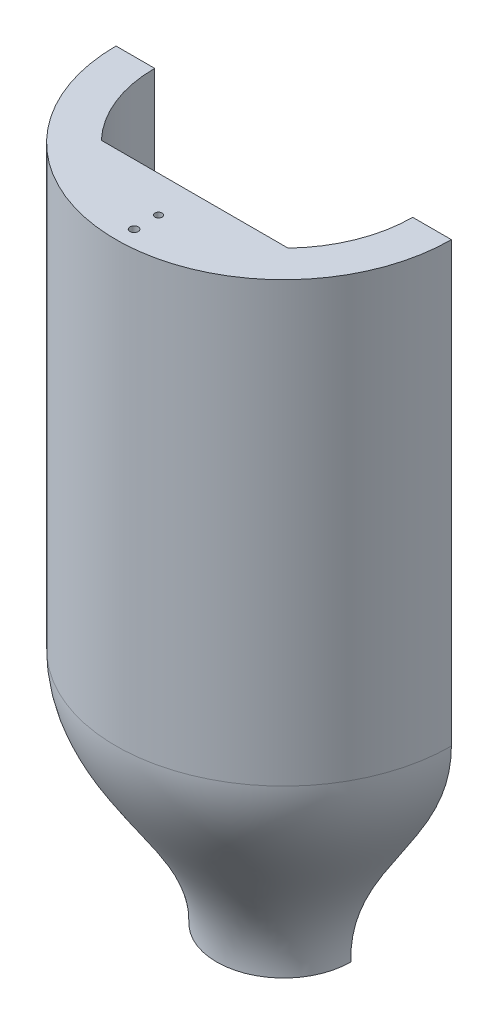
ISO-10303-21;
HEADER;
FILE_DESCRIPTION(('STEP AP214'),'2;1');
FILE_NAME('part.step','',(''),(''),'','','');
FILE_SCHEMA(('AUTOMOTIVE_DESIGN { 1 0 10303 214 1 1 1 1 }'));
ENDSEC;
DATA;
#1=APPLICATION_CONTEXT('core data for automotive mechanical design processes');
#2=APPLICATION_PROTOCOL_DEFINITION('international standard','automotive_design',2000,#1);
#3=PRODUCT_CONTEXT('',#1,'mechanical');
#4=PRODUCT('Part','Part','',(#3));
#5=PRODUCT_RELATED_PRODUCT_CATEGORY('part','',(#4));
#6=PRODUCT_DEFINITION_FORMATION('','',#4);
#7=PRODUCT_DEFINITION_CONTEXT('part definition',#1,'design');
#8=PRODUCT_DEFINITION('design','',#6,#7);
#9=PRODUCT_DEFINITION_SHAPE('','',#8);
#10=(LENGTH_UNIT() NAMED_UNIT(*) SI_UNIT(.MILLI.,.METRE.));
#11=(NAMED_UNIT(*) PLANE_ANGLE_UNIT() SI_UNIT($,.RADIAN.));
#12=(NAMED_UNIT(*) SI_UNIT($,.STERADIAN.) SOLID_ANGLE_UNIT());
#13=UNCERTAINTY_MEASURE_WITH_UNIT(LENGTH_MEASURE(1.E-05),#10,'distance_accuracy_value','');
#14=(GEOMETRIC_REPRESENTATION_CONTEXT(3) GLOBAL_UNCERTAINTY_ASSIGNED_CONTEXT((#13)) GLOBAL_UNIT_ASSIGNED_CONTEXT((#10,
#11,#12)) REPRESENTATION_CONTEXT('',''));
#15=CARTESIAN_POINT('',(0.,0.,0.));
#16=DIRECTION('',(0.,0.,1.));
#17=DIRECTION('',(1.,0.,0.));
#18=AXIS2_PLACEMENT_3D('',#15,#16,#17);
#19=CARTESIAN_POINT('',(-32.5,85.,0.));
#20=DIRECTION('',(0.,0.,1.));
#21=DIRECTION('',(1.,0.,0.));
#22=AXIS2_PLACEMENT_3D('',#19,#20,#21);
#23=PLANE('',#22);
#24=CARTESIAN_POINT('',(23.8066094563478,-16.,0.));
#25=DIRECTION('',(0.,0.,-1.));
#26=DIRECTION('',(-1.,0.,0.));
#27=AXIS2_PLACEMENT_3D('',#24,#25,#26);
#28=CIRCLE('',#27,0.799999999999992);
#29=CARTESIAN_POINT('',(23.0066094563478,-16.,0.));
#30=VERTEX_POINT('',#29);
#31=EDGE_CURVE('E149',#30,#30,#28,.T.);
#32=ORIENTED_EDGE('',*,*,#31,.F.);
#33=EDGE_LOOP('',(#32));
#34=FACE_BOUND('',#33,.T.);
#35=CARTESIAN_POINT('',(28.8066094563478,19.,0.));
#36=DIRECTION('',(0.,0.,-1.));
#37=DIRECTION('',(-1.,0.,0.));
#38=AXIS2_PLACEMENT_3D('',#35,#36,#37);
#39=CIRCLE('',#38,0.799999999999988);
#40=CARTESIAN_POINT('',(28.0066094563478,19.,0.));
#41=VERTEX_POINT('',#40);
#42=EDGE_CURVE('E166',#41,#41,#39,.T.);
#43=ORIENTED_EDGE('',*,*,#42,.F.);
#44=EDGE_LOOP('',(#43));
#45=FACE_BOUND('',#44,.T.);
#46=CARTESIAN_POINT('',(28.8,67.,0.));
#47=DIRECTION('',(0.,0.,-1.));
#48=DIRECTION('',(-1.,0.,0.));
#49=AXIS2_PLACEMENT_3D('',#46,#47,#48);
#50=CIRCLE('',#49,0.799999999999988);
#51=CARTESIAN_POINT('',(28.,67.,0.));
#52=VERTEX_POINT('',#51);
#53=EDGE_CURVE('E184',#52,#52,#50,.T.);
#54=ORIENTED_EDGE('',*,*,#53,.F.);
#55=EDGE_LOOP('',(#54));
#56=FACE_BOUND('',#55,.T.);
#57=DIRECTION('',(1.,0.,0.));
#58=VECTOR('',#57,1.);
#59=CARTESIAN_POINT('',(0.00476582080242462,-46.,0.));
#60=LINE('',#59,#58);
#61=CARTESIAN_POINT('',(8.30660945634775,-46.,0.));
#62=VERTEX_POINT('',#61);
#63=CARTESIAN_POINT('',(13.0047658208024,-46.,0.));
#64=VERTEX_POINT('',#63);
#65=EDGE_CURVE('E357',#62,#64,#60,.T.);
#66=ORIENTED_EDGE('',*,*,#65,.F.);
#67=CARTESIAN_POINT('',(25.,0.,0.));
#68=CARTESIAN_POINT('',(25.2586533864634,-16.633418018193,0.));
#69=CARTESIAN_POINT('',(9.46106074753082,-29.3804159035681,0.));
#70=CARTESIAN_POINT('',(8.30660945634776,-46.,0.));
#71=B_SPLINE_CURVE_WITH_KNOTS('',3,(#67,#68,#69,#70),.UNSPECIFIED.,.F.,.F.,(4,4),(0.,1.),.UNSPECIFIED.);
#72=CARTESIAN_POINT('',(25.,0.,0.));
#73=VERTEX_POINT('',#72);
#74=EDGE_CURVE('E61',#73,#62,#71,.T.);
#75=ORIENTED_EDGE('',*,*,#74,.F.);
#76=DIRECTION('',(0.,-1.,0.));
#77=VECTOR('',#76,1.);
#78=CARTESIAN_POINT('',(25.,160.,0.));
#79=LINE('',#78,#77);
#80=CARTESIAN_POINT('',(25.,85.,0.));
#81=VERTEX_POINT('',#80);
#82=EDGE_CURVE('E395',#81,#73,#79,.T.);
#83=ORIENTED_EDGE('',*,*,#82,.F.);
#84=DIRECTION('',(-1.,0.,0.));
#85=VECTOR('',#84,1.);
#86=CARTESIAN_POINT('',(-32.5,85.,0.));
#87=LINE('',#86,#85);
#88=CARTESIAN_POINT('',(32.5,85.,0.));
#89=VERTEX_POINT('',#88);
#90=EDGE_CURVE('E411',#89,#81,#87,.T.);
#91=ORIENTED_EDGE('',*,*,#90,.F.);
#92=DIRECTION('',(0.,-1.,0.));
#93=VECTOR('',#92,1.);
#94=CARTESIAN_POINT('',(32.5,85.,0.));
#95=LINE('',#94,#93);
#96=CARTESIAN_POINT('',(32.5,0.,0.));
#97=VERTEX_POINT('',#96);
#98=EDGE_CURVE('E46',#89,#97,#95,.T.);
#99=ORIENTED_EDGE('',*,*,#98,.T.);
#100=CARTESIAN_POINT('',(32.5,0.,0.));
#101=CARTESIAN_POINT('',(32.4106373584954,-17.2685956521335,0.));
#102=CARTESIAN_POINT('',(12.6235868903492,-29.138500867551,0.));
#103=CARTESIAN_POINT('',(13.0047658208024,-46.,0.));
#104=B_SPLINE_CURVE_WITH_KNOTS('',3,(#100,#101,#102,#103),.UNSPECIFIED.,.F.,.F.,(4,4),(0.,1.),.UNSPECIFIED.);
#105=EDGE_CURVE('E361',#97,#64,#104,.T.);
#106=ORIENTED_EDGE('',*,*,#105,.T.);
#107=EDGE_LOOP('',(#66,#75,#83,#91,#99,#106));
#108=FACE_BOUND('',#107,.T.);
#109=ADVANCED_FACE('F36',(#34,#45,#56,#108),#23,.F.);
#110=CARTESIAN_POINT('',(0.,85.,0.));
#111=DIRECTION('',(0.,-1.,0.));
#112=DIRECTION('',(0.,0.,-1.));
#113=AXIS2_PLACEMENT_3D('',#110,#111,#112);
#114=CYLINDRICAL_SURFACE('',#113,32.5);
#115=CARTESIAN_POINT('',(0.00476582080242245,0.,0.));
#116=DIRECTION('',(0.,-1.,0.));
#117=DIRECTION('',(1.,0.,0.));
#118=AXIS2_PLACEMENT_3D('',#115,#116,#117);
#119=CIRCLE('',#118,32.4952341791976);
#120=CARTESIAN_POINT('',(-32.4952341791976,0.,-1.13456503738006E-13));
#121=VERTEX_POINT('',#120);
#122=EDGE_CURVE('E380',#121,#97,#119,.F.);
#123=ORIENTED_EDGE('',*,*,#122,.T.);
#124=ORIENTED_EDGE('',*,*,#98,.F.);
#125=CARTESIAN_POINT('',(0.,85.,0.));
#126=DIRECTION('',(0.,1.,0.));
#127=DIRECTION('',(0.,0.,1.));
#128=AXIS2_PLACEMENT_3D('',#125,#126,#127);
#129=CIRCLE('',#128,32.5);
#130=CARTESIAN_POINT('',(-32.5,85.,0.));
#131=VERTEX_POINT('',#130);
#132=EDGE_CURVE('E407',#131,#89,#129,.T.);
#133=ORIENTED_EDGE('',*,*,#132,.F.);
#134=DIRECTION('',(0.,-1.,0.));
#135=VECTOR('',#134,1.);
#136=CARTESIAN_POINT('',(-32.5,85.,0.));
#137=LINE('',#136,#135);
#138=EDGE_CURVE('E414',#131,#121,#137,.T.);
#139=ORIENTED_EDGE('',*,*,#138,.T.);
#140=EDGE_LOOP('',(#123,#124,#133,#139));
#141=FACE_BOUND('',#140,.T.);
#142=ADVANCED_FACE('F38',(#141),#114,.T.);
#143=CARTESIAN_POINT('',(-23.7971975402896,-16.,0.));
#144=DIRECTION('',(0.,0.,-1.));
#145=DIRECTION('',(-1.,0.,0.));
#146=AXIS2_PLACEMENT_3D('',#143,#144,#145);
#147=CIRCLE('',#146,0.799999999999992);
#148=CARTESIAN_POINT('',(-24.5971975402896,-16.,0.));
#149=VERTEX_POINT('',#148);
#150=EDGE_CURVE('E160',#149,#149,#147,.T.);
#151=ORIENTED_EDGE('',*,*,#150,.F.);
#152=EDGE_LOOP('',(#151));
#153=FACE_BOUND('',#152,.T.);
#154=CARTESIAN_POINT('',(-28.7971975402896,19.,0.));
#155=DIRECTION('',(0.,0.,-1.));
#156=DIRECTION('',(-1.,0.,0.));
#157=AXIS2_PLACEMENT_3D('',#154,#155,#156);
#158=CIRCLE('',#157,0.799999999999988);
#159=CARTESIAN_POINT('',(-29.5971975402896,19.,0.));
#160=VERTEX_POINT('',#159);
#161=EDGE_CURVE('E172',#160,#160,#158,.T.);
#162=ORIENTED_EDGE('',*,*,#161,.F.);
#163=EDGE_LOOP('',(#162));
#164=FACE_BOUND('',#163,.T.);
#165=CARTESIAN_POINT('',(-28.7971975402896,67.,0.));
#166=DIRECTION('',(0.,0.,-1.));
#167=DIRECTION('',(-1.,0.,0.));
#168=AXIS2_PLACEMENT_3D('',#165,#166,#167);
#169=CIRCLE('',#168,0.799999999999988);
#170=CARTESIAN_POINT('',(-29.5971975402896,67.,0.));
#171=VERTEX_POINT('',#170);
#172=EDGE_CURVE('E178',#171,#171,#169,.T.);
#173=ORIENTED_EDGE('',*,*,#172,.F.);
#174=EDGE_LOOP('',(#173));
#175=FACE_BOUND('',#174,.T.);
#176=DIRECTION('',(0.,-1.,0.));
#177=VECTOR('',#176,1.);
#178=CARTESIAN_POINT('',(-25.,160.,-1.74574066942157E-13));
#179=LINE('',#178,#177);
#180=CARTESIAN_POINT('',(-25.,85.,-1.74574066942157E-13));
#181=VERTEX_POINT('',#180);
#182=CARTESIAN_POINT('',(-24.9999997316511,-0.00519772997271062,-1.74574066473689E-13));
#183=VERTEX_POINT('',#182);
#184=EDGE_CURVE('E312',#181,#183,#179,.T.);
#185=ORIENTED_EDGE('',*,*,#184,.T.);
#186=CARTESIAN_POINT('',(-24.9999994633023,-0.00518023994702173,-1.74574066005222E-13));
#187=CARTESIAN_POINT('',(-25.255206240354,-16.6386514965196,-1.76368199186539E-13));
#188=CARTESIAN_POINT('',(-9.45497264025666,-29.3823756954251,0.));
#189=CARTESIAN_POINT('',(-8.29707763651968,-46.0017202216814,0.));
#190=B_SPLINE_CURVE_WITH_KNOTS('',3,(#186,#187,#188,#189),.UNSPECIFIED.,.F.,.F.,(4,4),(0.,1.),.UNSPECIFIED.);
#191=CARTESIAN_POINT('',(-8.29719754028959,-45.9999999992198,0.));
#192=VERTEX_POINT('',#191);
#193=EDGE_CURVE('E262',#183,#192,#190,.T.);
#194=ORIENTED_EDGE('',*,*,#193,.T.);
#195=CARTESIAN_POINT('',(-12.9952341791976,-46.,0.));
#196=VERTEX_POINT('',#195);
#197=EDGE_CURVE('E364',#196,#192,#60,.T.);
#198=ORIENTED_EDGE('',*,*,#197,.F.);
#199=CARTESIAN_POINT('',(-32.4904683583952,0.,-2.26913007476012E-13));
#200=CARTESIAN_POINT('',(-32.4011057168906,-17.2685956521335,-2.26288991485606E-13));
#201=CARTESIAN_POINT('',(-12.6140552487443,-29.138500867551,0.));
#202=CARTESIAN_POINT('',(-12.9952341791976,-46.,0.));
#203=B_SPLINE_CURVE_WITH_KNOTS('',3,(#199,#200,#201,#202),.UNSPECIFIED.,.F.,.F.,(4,4),(0.,1.),.UNSPECIFIED.);
#204=EDGE_CURVE('E365',#121,#196,#203,.T.);
#205=ORIENTED_EDGE('',*,*,#204,.F.);
#206=ORIENTED_EDGE('',*,*,#138,.F.);
#207=EDGE_CURVE('E410',#181,#131,#87,.T.);
#208=ORIENTED_EDGE('',*,*,#207,.F.);
#209=EDGE_LOOP('',(#185,#194,#198,#205,#206,#208));
#210=FACE_BOUND('',#209,.T.);
#211=ADVANCED_FACE('F335',(#153,#164,#175,#210),#23,.F.);
#212=CARTESIAN_POINT('',(0.,85.,0.));
#213=DIRECTION('',(0.,1.,0.));
#214=DIRECTION('',(0.,0.,1.));
#215=AXIS2_PLACEMENT_3D('',#212,#213,#214);
#216=PLANE('',#215);
#217=CARTESIAN_POINT('',(0.,85.,29.));
#218=DIRECTION('',(0.,1.,0.));
#219=DIRECTION('',(0.,0.,1.));
#220=AXIS2_PLACEMENT_3D('',#217,#218,#219);
#221=CIRCLE('',#220,0.79999999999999);
#222=CARTESIAN_POINT('',(0.,85.,29.8));
#223=VERTEX_POINT('',#222);
#224=EDGE_CURVE('E150',#223,#223,#221,.T.);
#225=ORIENTED_EDGE('',*,*,#224,.F.);
#226=EDGE_LOOP('',(#225));
#227=FACE_BOUND('',#226,.T.);
#228=CARTESIAN_POINT('',(0.,85.,24.25));
#229=DIRECTION('',(0.,1.,0.));
#230=DIRECTION('',(0.,0.,1.));
#231=AXIS2_PLACEMENT_3D('',#228,#229,#230);
#232=CIRCLE('',#231,0.699999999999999);
#233=CARTESIAN_POINT('',(0.,85.,24.95));
#234=VERTEX_POINT('',#233);
#235=EDGE_CURVE('E196',#234,#234,#232,.T.);
#236=ORIENTED_EDGE('',*,*,#235,.F.);
#237=EDGE_LOOP('',(#236));
#238=FACE_BOUND('',#237,.T.);
#239=CARTESIAN_POINT('',(0.,85.,0.));
#240=DIRECTION('',(0.,1.,0.));
#241=DIRECTION('',(0.,0.,1.));
#242=AXIS2_PLACEMENT_3D('',#239,#240,#241);
#243=CIRCLE('',#242,25.);
#244=CARTESIAN_POINT('',(18.0952341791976,85.,17.25));
#245=VERTEX_POINT('',#244);
#246=EDGE_CURVE('E405',#245,#81,#243,.T.);
#247=ORIENTED_EDGE('',*,*,#246,.F.);
#248=DIRECTION('',(1.,0.,0.));
#249=VECTOR('',#248,1.);
#250=CARTESIAN_POINT('',(0.,85.,17.25));
#251=LINE('',#250,#249);
#252=CARTESIAN_POINT('',(-18.0952341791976,85.,17.25));
#253=VERTEX_POINT('',#252);
#254=EDGE_CURVE('E400',#253,#245,#251,.T.);
#255=ORIENTED_EDGE('',*,*,#254,.F.);
#256=CARTESIAN_POINT('',(0.,85.,0.));
#257=DIRECTION('',(0.,1.,0.));
#258=DIRECTION('',(0.,0.,1.));
#259=AXIS2_PLACEMENT_3D('',#256,#257,#258);
#260=CIRCLE('',#259,25.);
#261=EDGE_CURVE('E403',#181,#253,#260,.T.);
#262=ORIENTED_EDGE('',*,*,#261,.F.);
#263=ORIENTED_EDGE('',*,*,#207,.T.);
#264=ORIENTED_EDGE('',*,*,#132,.T.);
#265=ORIENTED_EDGE('',*,*,#90,.T.);
#266=EDGE_LOOP('',(#247,#255,#262,#263,#264,#265));
#267=FACE_BOUND('',#266,.T.);
#268=ADVANCED_FACE('F332',(#227,#238,#267),#216,.T.);
#269=CARTESIAN_POINT('',(0.,160.,0.));
#270=DIRECTION('',(0.,-1.,0.));
#271=DIRECTION('',(0.,0.,-1.));
#272=AXIS2_PLACEMENT_3D('',#269,#270,#271);
#273=CYLINDRICAL_SURFACE('',#272,25.);
#274=ORIENTED_EDGE('',*,*,#246,.T.);
#275=ORIENTED_EDGE('',*,*,#82,.T.);
#276=CARTESIAN_POINT('',(2.68348861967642E-07,-0.00259011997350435,0.));
#277=DIRECTION('',(-0.00010360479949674,0.999999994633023,0.));
#278=DIRECTION('',(-0.999999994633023,-0.00010360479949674,0.));
#279=AXIS2_PLACEMENT_3D('',#276,#277,#278);
#280=CIRCLE('',#279,24.9999998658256);
#281=CARTESIAN_POINT('',(18.0952341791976,-0.000715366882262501,17.25));
#282=VERTEX_POINT('',#281);
#283=EDGE_CURVE('E281',#282,#73,#280,.T.);
#284=ORIENTED_EDGE('',*,*,#283,.F.);
#285=DIRECTION('',(0.,-1.,0.));
#286=VECTOR('',#285,1.);
#287=CARTESIAN_POINT('',(18.0952341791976,160.,17.25));
#288=LINE('',#287,#286);
#289=EDGE_CURVE('E376',#245,#282,#288,.T.);
#290=ORIENTED_EDGE('',*,*,#289,.F.);
#291=EDGE_LOOP('',(#274,#275,#284,#290));
#292=FACE_BOUND('',#291,.T.);
#293=ADVANCED_FACE('F324',(#292),#273,.F.);
#294=CARTESIAN_POINT('',(0.,160.,0.));
#295=DIRECTION('',(0.,-1.,0.));
#296=DIRECTION('',(0.,0.,-1.));
#297=AXIS2_PLACEMENT_3D('',#294,#295,#296);
#298=CYLINDRICAL_SURFACE('',#297,25.);
#299=ORIENTED_EDGE('',*,*,#261,.T.);
#300=DIRECTION('',(0.,-1.,0.));
#301=VECTOR('',#300,1.);
#302=CARTESIAN_POINT('',(-18.0952341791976,160.,17.25));
#303=LINE('',#302,#301);
#304=CARTESIAN_POINT('',(-18.0952340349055,-0.00447784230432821,17.2499998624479));
#305=VERTEX_POINT('',#304);
#306=EDGE_CURVE('E54',#253,#305,#303,.T.);
#307=ORIENTED_EDGE('',*,*,#306,.T.);
#308=CARTESIAN_POINT('',(-25.,-0.00521522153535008,-1.7457406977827E-13));
#309=CARTESIAN_POINT('',(-25.0000076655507,-0.00521503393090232,0.396609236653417));
#310=CARTESIAN_POINT('',(-24.990562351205,-0.00521386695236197,0.793217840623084));
#311=CARTESIAN_POINT('',(-24.9528208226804,-0.00520957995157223,1.58553719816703));
#312=CARTESIAN_POINT('',(-24.9245246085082,-0.00520645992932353,1.98124795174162));
#313=CARTESIAN_POINT('',(-24.8491363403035,-0.0051982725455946,2.77087502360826));
#314=CARTESIAN_POINT('',(-24.8020442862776,-0.00519320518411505,3.16479134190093));
#315=CARTESIAN_POINT('',(-24.6891734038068,-0.00518113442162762,3.94993756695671));
#316=CARTESIAN_POINT('',(-24.6233945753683,-0.00517413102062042,4.34116747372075));
#317=CARTESIAN_POINT('',(-24.4732984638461,-0.00515820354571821,5.12005483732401));
#318=CARTESIAN_POINT('',(-24.3889811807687,-0.00514927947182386,5.50771229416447));
#319=CARTESIAN_POINT('',(-24.2019992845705,-0.00512953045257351,6.27857684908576));
#320=CARTESIAN_POINT('',(-24.0993346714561,-0.00511870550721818,6.66178394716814));
#321=CARTESIAN_POINT('',(-23.8758905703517,-0.00509517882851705,7.42287994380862));
#322=CARTESIAN_POINT('',(-23.7551110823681,-0.0050824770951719,7.80076884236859));
#323=CARTESIAN_POINT('',(-23.4957107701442,-0.00505522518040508,8.55037264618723));
#324=CARTESIAN_POINT('',(-23.3570899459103,-0.00504067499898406,8.92208755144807));
#325=CARTESIAN_POINT('',(-23.0623208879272,-0.00500975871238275,9.65850155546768));
#326=CARTESIAN_POINT('',(-22.9061726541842,-0.00499339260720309,10.0232006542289));
#327=CARTESIAN_POINT('',(-22.5767024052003,-0.00495888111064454,10.7447571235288));
#328=CARTESIAN_POINT('',(-22.4033803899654,-0.00494073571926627,11.1016144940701));
#329=CARTESIAN_POINT('',(-22.0399550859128,-0.00490270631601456,11.8066793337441));
#330=CARTESIAN_POINT('',(-21.8498517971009,-0.00488282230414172,12.1548868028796));
#331=CARTESIAN_POINT('',(-21.4532945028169,-0.00484136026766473,12.8418632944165));
#332=CARTESIAN_POINT('',(-21.2468404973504,-0.00481978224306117,13.1806323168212));
#333=CARTESIAN_POINT('',(-20.8180491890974,-0.00477498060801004,13.8479646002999));
#334=CARTESIAN_POINT('',(-20.5957118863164,-0.00475175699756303,14.1765278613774));
#335=CARTESIAN_POINT('',(-20.135657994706,-0.00470371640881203,14.8227049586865));
#336=CARTESIAN_POINT('',(-19.897941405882,-0.00467889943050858,15.140318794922));
#337=CARTESIAN_POINT('',(-19.4076654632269,-0.00462772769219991,15.7638761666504));
#338=CARTESIAN_POINT('',(-19.155106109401,-0.00460137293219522,16.0698197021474));
#339=CARTESIAN_POINT('',(-18.635723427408,-0.00454718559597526,16.6693495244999));
#340=CARTESIAN_POINT('',(-18.3689000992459,-0.00451935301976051,16.9629358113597));
#341=CARTESIAN_POINT('',(-18.0952341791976,-0.00449081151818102,17.25));
#342=B_SPLINE_CURVE_WITH_KNOTS('',3,(#308,#309,#310,#311,#312,#313,#314,#315,#316,#317,#318,
#319,#320,#321,#322,#323,#324,#325,#326,#327,#328,#329,#330,#331,#332,#333,#334,#335,#336,#337,
#338,#339,#340,#341),.UNSPECIFIED.,.F.,.F.,(4,2,2,2,2,2,2,2,2,2,2,2,2,2,2,2,4),(0.,
1.18971435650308,2.37942871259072,3.56914306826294,4.75885742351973,5.94857177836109,
7.13828613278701,8.3280004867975,9.51771484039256,10.7074291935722,11.8971435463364,
13.0868578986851,14.2765722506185,15.4662866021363,16.6560009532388,17.8457153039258,
19.0354296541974),.UNSPECIFIED.);
#343=EDGE_CURVE('E306',#183,#305,#342,.T.);
#344=ORIENTED_EDGE('',*,*,#343,.F.);
#345=ORIENTED_EDGE('',*,*,#184,.F.);
#346=EDGE_LOOP('',(#299,#307,#344,#345));
#347=FACE_BOUND('',#346,.T.);
#348=ADVANCED_FACE('F314',(#347),#298,.F.);
#349=CARTESIAN_POINT('',(18.0952341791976,160.,17.25));
#350=DIRECTION('',(0.,0.,1.));
#351=DIRECTION('',(1.,0.,0.));
#352=AXIS2_PLACEMENT_3D('',#349,#350,#351);
#353=PLANE('',#352);
#354=CARTESIAN_POINT('',(0.00476582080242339,7.50000000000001,17.25));
#355=DIRECTION('',(0.,0.,-1.));
#356=DIRECTION('',(-1.,0.,0.));
#357=AXIS2_PLACEMENT_3D('',#354,#355,#356);
#358=CIRCLE('',#357,0.79999999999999);
#359=CARTESIAN_POINT('',(-0.795234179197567,7.50000000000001,17.25));
#360=VERTEX_POINT('',#359);
#361=EDGE_CURVE('E206',#360,#360,#358,.T.);
#362=ORIENTED_EDGE('',*,*,#361,.F.);
#363=EDGE_LOOP('',(#362));
#364=FACE_BOUND('',#363,.T.);
#365=CARTESIAN_POINT('',(0.00476582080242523,22.5,17.25));
#366=DIRECTION('',(0.,0.,-1.));
#367=DIRECTION('',(-1.,0.,0.));
#368=AXIS2_PLACEMENT_3D('',#365,#366,#367);
#369=CIRCLE('',#368,0.79999999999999);
#370=CARTESIAN_POINT('',(-0.795234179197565,22.5,17.25));
#371=VERTEX_POINT('',#370);
#372=EDGE_CURVE('E806',#371,#371,#369,.T.);
#373=ORIENTED_EDGE('',*,*,#372,.F.);
#374=EDGE_LOOP('',(#373));
#375=FACE_BOUND('',#374,.T.);
#376=CARTESIAN_POINT('',(0.00476582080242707,37.5,17.25));
#377=DIRECTION('',(0.,0.,-1.));
#378=DIRECTION('',(-1.,0.,0.));
#379=AXIS2_PLACEMENT_3D('',#376,#377,#378);
#380=CIRCLE('',#379,0.79999999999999);
#381=CARTESIAN_POINT('',(-0.795234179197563,37.5,17.25));
#382=VERTEX_POINT('',#381);
#383=EDGE_CURVE('E810',#382,#382,#380,.T.);
#384=ORIENTED_EDGE('',*,*,#383,.F.);
#385=EDGE_LOOP('',(#384));
#386=FACE_BOUND('',#385,.T.);
#387=CARTESIAN_POINT('',(0.00476582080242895,52.5,17.25));
#388=DIRECTION('',(0.,0.,-1.));
#389=DIRECTION('',(-1.,0.,0.));
#390=AXIS2_PLACEMENT_3D('',#387,#388,#389);
#391=CIRCLE('',#390,0.79999999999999);
#392=CARTESIAN_POINT('',(-0.795234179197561,52.5,17.25));
#393=VERTEX_POINT('',#392);
#394=EDGE_CURVE('E813',#393,#393,#391,.T.);
#395=ORIENTED_EDGE('',*,*,#394,.F.);
#396=EDGE_LOOP('',(#395));
#397=FACE_BOUND('',#396,.T.);
#398=ORIENTED_EDGE('',*,*,#254,.T.);
#399=ORIENTED_EDGE('',*,*,#289,.T.);
#400=CARTESIAN_POINT('',(-35.5201402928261,-0.00777112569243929,17.25));
#401=CARTESIAN_POINT('',(-31.8620211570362,-0.00705934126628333,17.25));
#402=CARTESIAN_POINT('',(-28.2039020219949,-0.00634294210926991,17.25));
#403=CARTESIAN_POINT('',(-20.8876637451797,-0.00495966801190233,17.25));
#404=CARTESIAN_POINT('',(-17.2295446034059,-0.00429279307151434,17.25));
#405=CARTESIAN_POINT('',(-9.9133062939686,-0.00306732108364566,17.25));
#406=CARTESIAN_POINT('',(-6.25518712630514,-0.00250872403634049,17.25));
#407=CARTESIAN_POINT('',(1.06105124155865,-0.00164406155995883,17.25));
#408=CARTESIAN_POINT('',(4.71917044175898,-0.00133799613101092,17.25));
#409=CARTESIAN_POINT('',(13.8058617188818,-0.00079366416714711,17.25));
#410=CARTESIAN_POINT('',(19.2344338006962,-0.00065990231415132,17.25));
#411=CARTESIAN_POINT('',(30.0915779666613,-0.000466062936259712,17.25));
#412=CARTESIAN_POINT('',(35.5201500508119,-0.000405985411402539,17.25));
#413=CARTESIAN_POINT('',(46.3772942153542,-0.000316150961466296,17.25));
#414=CARTESIAN_POINT('',(51.8058662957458,-0.000286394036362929,17.25));
#415=CARTESIAN_POINT('',(62.6630104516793,-0.000240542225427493,17.25));
#416=CARTESIAN_POINT('',(68.0915825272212,-0.000224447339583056,17.25));
#417=CARTESIAN_POINT('',(73.5201546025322,-0.000206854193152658,17.25));
#418=B_SPLINE_CURVE_WITH_KNOTS('',3,(#400,#401,#402,#403,#404,#405,#406,#407,#408,#409,#410,
#411,#412,#413,#414,#415,#416,#417),.UNSPECIFIED.,.F.,.F.,(4,2,2,2,2,2,2,2,4),(0.,
10.9743576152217,21.948715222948,32.9230728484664,43.8974304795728,60.1831467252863,
76.4688629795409,92.754579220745,109.040295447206),.UNSPECIFIED.);
#419=EDGE_CURVE('E266',#305,#282,#418,.T.);
#420=ORIENTED_EDGE('',*,*,#419,.F.);
#421=ORIENTED_EDGE('',*,*,#306,.F.);
#422=EDGE_LOOP('',(#398,#399,#420,#421));
#423=FACE_BOUND('',#422,.T.);
#424=ADVANCED_FACE('F323',(#364,#375,#386,#397,#423),#353,.F.);
#425=CARTESIAN_POINT('',(0.00476582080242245,0.,0.));
#426=DIRECTION('',(0.,1.,0.));
#427=AXIS1_PLACEMENT('',#425,#426);
#428=SURFACE_OF_REVOLUTION('',#203,#427);
#429=ORIENTED_EDGE('',*,*,#122,.F.);
#430=ORIENTED_EDGE('',*,*,#204,.T.);
#431=CARTESIAN_POINT('',(0.00476582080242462,-46.,0.));
#432=DIRECTION('',(0.,1.,0.));
#433=DIRECTION('',(-1.,0.,0.));
#434=AXIS2_PLACEMENT_3D('',#431,#432,#433);
#435=CIRCLE('',#434,13.);
#436=EDGE_CURVE('E368',#196,#64,#435,.T.);
#437=ORIENTED_EDGE('',*,*,#436,.T.);
#438=ORIENTED_EDGE('',*,*,#105,.F.);
#439=EDGE_LOOP('',(#429,#430,#437,#438));
#440=FACE_BOUND('',#439,.T.);
#441=ADVANCED_FACE('F291',(#440),#428,.F.);
#442=CARTESIAN_POINT('',(0.00476582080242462,-46.,0.));
#443=DIRECTION('',(0.,-1.,0.));
#444=DIRECTION('',(1.,0.,0.));
#445=AXIS2_PLACEMENT_3D('',#442,#443,#444);
#446=PLANE('',#445);
#447=CARTESIAN_POINT('',(0.,-46.,10.5000000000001));
#448=DIRECTION('',(0.,-1.,0.));
#449=DIRECTION('',(0.,0.,-1.));
#450=AXIS2_PLACEMENT_3D('',#447,#448,#449);
#451=CIRCLE('',#450,0.79999999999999);
#452=CARTESIAN_POINT('',(0.,-46.,9.70000000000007));
#453=VERTEX_POINT('',#452);
#454=EDGE_CURVE('E190',#453,#453,#451,.T.);
#455=ORIENTED_EDGE('',*,*,#454,.F.);
#456=EDGE_LOOP('',(#455));
#457=FACE_BOUND('',#456,.T.);
#458=CARTESIAN_POINT('',(8.30660945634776,-46.,0.));
#459=CARTESIAN_POINT('',(8.30663456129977,-46.,0.233493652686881));
#460=CARTESIAN_POINT('',(8.29675988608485,-46.,0.466983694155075));
#461=CARTESIAN_POINT('',(8.25739230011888,-46.,0.932293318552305));
#462=CARTESIAN_POINT('',(8.22790032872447,-46.,1.1641129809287));
#463=CARTESIAN_POINT('',(8.14950700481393,-46.,1.62427950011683));
#464=CARTESIAN_POINT('',(8.10061931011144,-46.,1.85262868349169));
#465=CARTESIAN_POINT('',(7.98379021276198,-46.,2.30439651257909));
#466=CARTESIAN_POINT('',(7.91584904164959,-46.,2.52781521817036));
#467=CARTESIAN_POINT('',(7.76135745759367,-46.,2.9682396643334));
#468=CARTESIAN_POINT('',(7.67479843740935,-46.,3.18524238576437));
#469=CARTESIAN_POINT('',(7.48370429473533,-46.,3.61118708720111));
#470=CARTESIAN_POINT('',(7.3791688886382,-46.,3.82012893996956));
#471=CARTESIAN_POINT('',(7.15288902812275,-46.,4.22842117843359));
#472=CARTESIAN_POINT('',(7.03114805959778,-46.,4.4277734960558));
#473=CARTESIAN_POINT('',(6.77130708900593,-46.,4.81551401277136));
#474=CARTESIAN_POINT('',(6.63320716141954,-46.,5.00390226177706));
#475=CARTESIAN_POINT('',(6.34165117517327,-46.,5.36834939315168));
#476=CARTESIAN_POINT('',(6.1881974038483,-46.,5.54441010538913));
#477=CARTESIAN_POINT('',(5.8669513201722,-46.,5.88304060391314));
#478=CARTESIAN_POINT('',(5.69915406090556,-46.,6.04560569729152));
#479=CARTESIAN_POINT('',(5.35046491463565,-46.,6.35601648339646));
#480=CARTESIAN_POINT('',(5.16957339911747,-46.,6.50386259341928));
#481=CARTESIAN_POINT('',(4.79597479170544,-46.,6.78379163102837));
#482=CARTESIAN_POINT('',(4.60326751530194,-46.,6.91587431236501));
#483=CARTESIAN_POINT('',(4.20742270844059,-46.,7.16332680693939));
#484=CARTESIAN_POINT('',(4.00428583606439,-46.,7.27869767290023));
#485=CARTESIAN_POINT('',(3.58901030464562,-46.,7.49191855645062));
#486=CARTESIAN_POINT('',(3.37687144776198,-46.,7.58976818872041));
#487=CARTESIAN_POINT('',(2.9451579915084,-46.,7.76722577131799));
#488=CARTESIAN_POINT('',(2.72558524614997,-46.,7.84683823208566));
#489=CARTESIAN_POINT('',(2.28043768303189,-46.,7.98731099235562));
#490=CARTESIAN_POINT('',(2.05486082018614,-46.,8.04816481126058));
#491=CARTESIAN_POINT('',(1.59941908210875,-46.,8.15064194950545));
#492=CARTESIAN_POINT('',(1.36955490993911,-46.,8.19226839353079));
#493=CARTESIAN_POINT('',(0.907132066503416,-46.,8.25601014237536));
#494=CARTESIAN_POINT('',(0.674573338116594,-46.,8.27812503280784));
#495=CARTESIAN_POINT('',(0.208416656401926,-46.,8.3026850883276));
#496=CARTESIAN_POINT('',(-0.0251813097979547,-46.,8.30513000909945));
#497=CARTESIAN_POINT('',(-0.491752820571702,-46.,8.2903321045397));
#498=CARTESIAN_POINT('',(-0.724726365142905,-46.,8.2730892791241));
#499=CARTESIAN_POINT('',(-1.18839285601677,-46.,8.21903844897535));
#500=CARTESIAN_POINT('',(-1.41908580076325,-46.,8.18223043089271));
#501=CARTESIAN_POINT('',(-1.87654591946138,-46.,8.08931189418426));
#502=CARTESIAN_POINT('',(-2.10331317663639,-46.,8.03320178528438));
#503=CARTESIAN_POINT('',(-2.55135519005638,-46.,7.90206596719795));
#504=CARTESIAN_POINT('',(-2.77262895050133,-46.,7.82703685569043));
#505=CARTESIAN_POINT('',(-3.20799272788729,-46.,7.65863074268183));
#506=CARTESIAN_POINT('',(-3.42208519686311,-46.,7.56526008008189));
#507=CARTESIAN_POINT('',(-3.84168906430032,-46.,7.36079654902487));
#508=CARTESIAN_POINT('',(-4.04719865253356,-46.,7.24969996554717));
#509=CARTESIAN_POINT('',(-4.44812343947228,-46.,7.01059117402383));
#510=CARTESIAN_POINT('',(-4.64353886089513,-46.,6.88257933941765));
#511=CARTESIAN_POINT('',(-5.02288510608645,-46.,6.61055240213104));
#512=CARTESIAN_POINT('',(-5.2068162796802,-46.,6.46653778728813));
#513=CARTESIAN_POINT('',(-5.56189012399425,-46.,6.16352832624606));
#514=CARTESIAN_POINT('',(-5.73303299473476,-46.,6.00453371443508));
#515=CARTESIAN_POINT('',(-6.06132438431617,-46.,5.67268493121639));
#516=CARTESIAN_POINT('',(-6.21847225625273,-46.,5.49983011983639));
#517=CARTESIAN_POINT('',(-6.51759568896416,-46.,5.14155833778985));
#518=CARTESIAN_POINT('',(-6.65957647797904,-46.,4.95614573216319));
#519=CARTESIAN_POINT('',(-6.9274872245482,-46.,4.57392542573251));
#520=CARTESIAN_POINT('',(-7.05340901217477,-46.,4.37711199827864));
#521=CARTESIAN_POINT('',(-7.28821830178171,-46.,3.97358131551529));
#522=CARTESIAN_POINT('',(-7.39710632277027,-46.,3.76686436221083));
#523=CARTESIAN_POINT('',(-7.59714189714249,-46.,3.34485755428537));
#524=CARTESIAN_POINT('',(-7.68827814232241,-46.,3.12956233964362));
#525=CARTESIAN_POINT('',(-7.85207337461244,-46.,2.69205800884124));
#526=CARTESIAN_POINT('',(-7.92473276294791,-46.,2.46984904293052));
#527=CARTESIAN_POINT('',(-8.05097826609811,-46.,2.02039048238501));
#528=CARTESIAN_POINT('',(-8.10458865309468,-46.,1.7931476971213));
#529=CARTESIAN_POINT('',(-8.1924648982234,-46.,1.33504517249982));
#530=CARTESIAN_POINT('',(-8.2267402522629,-46.,1.10418726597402));
#531=CARTESIAN_POINT('',(-8.26655888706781,-46.,0.727355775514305));
#532=CARTESIAN_POINT('',(-8.27805570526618,-46.,0.581985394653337));
#533=CARTESIAN_POINT('',(-8.29336952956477,-46.,0.291081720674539));
#534=CARTESIAN_POINT('',(-8.29719920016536,-46.,0.145549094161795));
#535=CARTESIAN_POINT('',(-8.29719754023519,-46.,0.));
#536=B_SPLINE_CURVE_WITH_KNOTS('',3,(#458,#459,#460,#461,#462,#463,#464,#465,#466,#467,#468,
#469,#470,#471,#472,#473,#474,#475,#476,#477,#478,#479,#480,#481,#482,#483,#484,#485,#486,#487,
#488,#489,#490,#491,#492,#493,#494,#495,#496,#497,#498,#499,#500,#501,#502,#503,#504,#505,#506,
#507,#508,#509,#510,#511,#512,#513,#514,#515,#516,#517,#518,#519,#520,#521,#522,#523,#524,#525,
#526,#527,#528,#529,#530,#531,#532,#533,#534,#535),.UNSPECIFIED.,.F.,.F.,(4,2,2,2,2,2,2,2,2,2,2,
2,2,2,2,2,2,2,2,2,2,2,2,2,2,2,2,2,2,2,2,2,2,2,2,2,2,2,4),(0.,0.700267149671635,1.40050077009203,
2.10024218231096,2.79997509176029,3.50003219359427,4.20010034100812,4.90002685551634,
5.59995018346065,6.29976939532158,6.99983094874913,7.69987264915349,8.39992528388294,
9.09993380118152,9.79995771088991,10.4998083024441,11.1999004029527,11.899878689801,
12.5998718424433,13.2998736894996,13.9998755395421,14.699877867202,15.3998653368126,
16.0999787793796,16.7998506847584,17.4998694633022,18.1998727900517,18.8998547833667,
19.5998258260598,20.2998292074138,20.9995905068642,21.699706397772,22.3998009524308,
23.1003400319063,23.8008638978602,24.5004919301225,25.1997760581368,25.637063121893,
26.0736272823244),.UNSPECIFIED.);
#537=EDGE_CURVE('E11',#62,#192,#536,.T.);
#538=ORIENTED_EDGE('',*,*,#537,.F.);
#539=ORIENTED_EDGE('',*,*,#65,.T.);
#540=ORIENTED_EDGE('',*,*,#436,.F.);
#541=ORIENTED_EDGE('',*,*,#197,.T.);
#542=EDGE_LOOP('',(#538,#539,#540,#541));
#543=FACE_BOUND('',#542,.T.);
#544=ADVANCED_FACE('F325',(#457,#543),#446,.T.);
#545=CARTESIAN_POINT('',(0.,0.,0.));
#546=DIRECTION('',(0.00010360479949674,-0.999999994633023,0.));
#547=DIRECTION('',(0.999999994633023,0.00010360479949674,0.));
#548=AXIS2_PLACEMENT_3D('',#545,#546,#547);
#549=CONICAL_SURFACE('',#548,0.,1.57069272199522);
#550=CARTESIAN_POINT('',(-0.494974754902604,-0.0025129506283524,23.7550252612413));
#551=CARTESIAN_POINT('',(-0.467170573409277,-0.00250713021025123,23.7272235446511));
#552=CARTESIAN_POINT('',(-0.436998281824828,-0.00250130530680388,23.7017496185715));
#553=CARTESIAN_POINT('',(-0.372779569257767,-0.00248982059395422,23.656208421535));
#554=CARTESIAN_POINT('',(-0.338728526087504,-0.00248416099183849,23.6361476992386));
#555=CARTESIAN_POINT('',(-0.267754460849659,-0.00247317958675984,23.6020367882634));
#556=CARTESIAN_POINT('',(-0.230832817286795,-0.00246785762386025,23.5879837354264));
#557=CARTESIAN_POINT('',(-0.15516433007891,-0.00245770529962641,23.5662799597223));
#558=CARTESIAN_POINT('',(-0.116417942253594,-0.00245287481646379,23.5586276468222));
#559=CARTESIAN_POINT('',(-0.0381860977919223,-0.00244384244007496,23.5499351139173));
#560=CARTESIAN_POINT('',(0.00129943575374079,-0.00243964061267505,23.5488955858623));
#561=CARTESIAN_POINT('',(0.0798860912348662,-0.00243198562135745,23.5534603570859));
#562=CARTESIAN_POINT('',(0.118987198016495,-0.00242853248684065,23.5590649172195));
#563=CARTESIAN_POINT('',(0.195692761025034,-0.00242247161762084,23.5767589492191));
#564=CARTESIAN_POINT('',(0.2332972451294,-0.00241986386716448,23.5888483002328));
#565=CARTESIAN_POINT('',(0.305942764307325,-0.00241556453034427,23.6191686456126));
#566=CARTESIAN_POINT('',(0.34098380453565,-0.0024138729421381,23.6373996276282));
#567=CARTESIAN_POINT('',(0.407507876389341,-0.00241144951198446,23.6794857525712));
#568=CARTESIAN_POINT('',(0.438990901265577,-0.00241071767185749,23.7033409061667));
#569=CARTESIAN_POINT('',(0.497505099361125,-0.00241022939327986,23.7559981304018));
#570=CARTESIAN_POINT('',(0.524536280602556,-0.00241047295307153,23.7848001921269));
#571=CARTESIAN_POINT('',(0.573379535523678,-0.00241192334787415,23.8465336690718));
#572=CARTESIAN_POINT('',(0.595191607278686,-0.00241313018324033,23.8794650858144));
#573=CARTESIAN_POINT('',(0.632977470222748,-0.00241646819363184,23.9485224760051));
#574=CARTESIAN_POINT('',(0.648951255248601,-0.00241859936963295,23.9846484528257));
#575=CARTESIAN_POINT('',(0.67460705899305,-0.00242372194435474,24.0590694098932));
#576=CARTESIAN_POINT('',(0.684289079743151,-0.00242671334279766,24.09736438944));
#577=CARTESIAN_POINT('',(0.697086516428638,-0.00243346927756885,24.175036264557));
#578=CARTESIAN_POINT('',(0.700201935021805,-0.00243723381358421,24.2144131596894));
#579=CARTESIAN_POINT('',(0.69977773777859,-0.00244542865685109,24.2931310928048));
#580=CARTESIAN_POINT('',(0.696238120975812,-0.0024498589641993,24.3324721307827));
#581=CARTESIAN_POINT('',(0.682604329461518,-0.00245926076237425,24.4100015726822));
#582=CARTESIAN_POINT('',(0.672510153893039,-0.00246423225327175,24.4481899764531));
#583=CARTESIAN_POINT('',(0.646053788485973,-0.00247457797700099,24.5223300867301));
#584=CARTESIAN_POINT('',(0.629691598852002,-0.00247995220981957,24.5582817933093));
#585=CARTESIAN_POINT('',(0.591163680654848,-0.00249095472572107,24.6269279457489));
#586=CARTESIAN_POINT('',(0.568997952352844,-0.00249658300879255,24.659622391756));
#587=CARTESIAN_POINT('',(0.519492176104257,-0.00250793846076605,24.7208259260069));
#588=CARTESIAN_POINT('',(0.492152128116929,-0.00251366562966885,24.7493350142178));
#589=CARTESIAN_POINT('',(0.433073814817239,-0.0025250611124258,24.8013585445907));
#590=CARTESIAN_POINT('',(0.401335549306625,-0.0025307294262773,24.8248729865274));
#591=CARTESIAN_POINT('',(0.334361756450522,-0.00254185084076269,24.8662397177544));
#592=CARTESIAN_POINT('',(0.2991262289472,-0.00254730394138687,24.8840920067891));
#593=CARTESIAN_POINT('',(0.226158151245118,-0.00255784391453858,24.9136276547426));
#594=CARTESIAN_POINT('',(0.188425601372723,-0.00256293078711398,24.9253110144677));
#595=CARTESIAN_POINT('',(0.111534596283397,-0.00257259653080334,24.9421771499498));
#596=CARTESIAN_POINT('',(0.0723761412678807,-0.00257717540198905,24.947359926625));
#597=CARTESIAN_POINT('',(-0.00625510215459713,-0.00258569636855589,24.9510777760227));
#598=CARTESIAN_POINT('',(-0.0457278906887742,-0.00258963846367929,24.9496128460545));
#599=CARTESIAN_POINT('',(-0.123867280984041,-0.00259677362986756,24.9400768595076));
#600=CARTESIAN_POINT('',(-0.162533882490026,-0.00259996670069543,24.9320058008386));
#601=CARTESIAN_POINT('',(-0.237963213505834,-0.00260551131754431,24.9094866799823));
#602=CARTESIAN_POINT('',(-0.274725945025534,-0.00260786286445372,24.8950386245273));
#603=CARTESIAN_POINT('',(-0.345303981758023,-0.00261165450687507,24.8601756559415));
#604=CARTESIAN_POINT('',(-0.379119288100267,-0.00261309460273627,24.839760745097));
#605=CARTESIAN_POINT('',(-0.442842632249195,-0.00261501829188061,24.7935435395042));
#606=CARTESIAN_POINT('',(-0.472750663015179,-0.0026155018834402,24.7677412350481));
#607=CARTESIAN_POINT('',(-0.527810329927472,-0.00261549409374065,24.7114817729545));
#608=CARTESIAN_POINT('',(-0.552961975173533,-0.00261500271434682,24.6810246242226));
#609=CARTESIAN_POINT('',(-0.597795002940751,-0.00261305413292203,24.6163199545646));
#610=CARTESIAN_POINT('',(-0.617476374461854,-0.00261159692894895,24.5820724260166));
#611=CARTESIAN_POINT('',(-0.650810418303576,-0.00260775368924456,24.5107585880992));
#612=CARTESIAN_POINT('',(-0.664462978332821,-0.00260536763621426,24.4736922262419));
#613=CARTESIAN_POINT('',(-0.685350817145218,-0.00259973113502,24.3977949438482));
#614=CARTESIAN_POINT('',(-0.692586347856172,-0.00259648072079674,24.3589640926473));
#615=CARTESIAN_POINT('',(-0.700435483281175,-0.00258920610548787,24.2806431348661));
#616=CARTESIAN_POINT('',(-0.701049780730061,-0.0025851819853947,24.2411530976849));
#617=CARTESIAN_POINT('',(-0.695639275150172,-0.00257647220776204,24.1626196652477));
#618=CARTESIAN_POINT('',(-0.689612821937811,-0.00257178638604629,24.1235763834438));
#619=CARTESIAN_POINT('',(-0.671088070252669,-0.00256188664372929,24.0470407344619));
#620=CARTESIAN_POINT('',(-0.658586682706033,-0.00255667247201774,24.0095491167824));
#621=CARTESIAN_POINT('',(-0.627472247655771,-0.0025458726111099,23.9372308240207));
#622=CARTESIAN_POINT('',(-0.608866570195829,-0.00254028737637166,23.9024009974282));
#623=CARTESIAN_POINT('',(-0.574131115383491,-0.00253104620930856,23.8487784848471));
#624=CARTESIAN_POINT('',(-0.55969044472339,-0.00252745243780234,23.82887082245));
#625=CARTESIAN_POINT('',(-0.528799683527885,-0.00252022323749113,23.7906808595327));
#626=CARTESIAN_POINT('',(-0.512349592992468,-0.00251658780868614,23.7723985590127));
#627=CARTESIAN_POINT('',(-0.494974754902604,-0.0025129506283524,23.7550252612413));
#628=B_SPLINE_CURVE_WITH_KNOTS('',3,(#550,#551,#552,#553,#554,#555,#556,#557,#558,#559,#560,
#561,#562,#563,#564,#565,#566,#567,#568,#569,#570,#571,#572,#573,#574,#575,#576,#577,#578,#579,
#580,#581,#582,#583,#584,#585,#586,#587,#588,#589,#590,#591,#592,#593,#594,#595,#596,#597,#598,
#599,#600,#601,#602,#603,#604,#605,#606,#607,#608,#609,#610,#611,#612,#613,#614,#615,#616,#617,
#618,#619,#620,#621,#622,#623,#624,#625,#626,#627),.UNSPECIFIED.,.T.,.F.,(4,2,2,2,2,2,2,2,2,2,2,
2,2,2,2,2,2,2,2,2,2,2,2,2,2,2,2,2,2,2,2,2,2,2,2,2,2,2,4),(0.,0.117868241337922,0.23587844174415,
0.353832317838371,0.471756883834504,0.589693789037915,0.707635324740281,0.825574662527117,
0.943513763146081,1.06145308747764,1.17939219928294,1.29733135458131,1.41527063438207,
1.5332098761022,1.65114907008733,1.76908828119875,1.88702750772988,2.00496673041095,
2.12290594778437,2.24084516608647,2.35878438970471,2.47672361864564,2.59466283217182,
2.71260202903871,2.83054127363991,2.94848055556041,3.06641971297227,3.1843588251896,
3.30229814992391,3.42023724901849,3.53817658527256,3.65611811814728,3.7740550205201,
3.89197958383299,4.0099334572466,4.1279436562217,4.24581189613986,4.31946778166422,
4.39312366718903),.UNSPECIFIED.);
#629=CARTESIAN_POINT('',(-0.494974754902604,-0.0025129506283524,23.7550252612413));
#630=VERTEX_POINT('',#629);
#631=EDGE_CURVE('E199',#630,#630,#628,.T.);
#632=ORIENTED_EDGE('',*,*,#631,.F.);
#633=EDGE_LOOP('',(#632));
#634=FACE_BOUND('',#633,.T.);
#635=EDGE_CURVE('E440',#305,#282,#280,.T.);
#636=ORIENTED_EDGE('',*,*,#635,.F.);
#637=ORIENTED_EDGE('',*,*,#419,.T.);
#638=EDGE_LOOP('',(#636,#637));
#639=FACE_BOUND('',#638,.T.);
#640=ADVANCED_FACE('F248',(#634,#639),#549,.F.);
#641=CARTESIAN_POINT('',(0.,0.,0.));
#642=DIRECTION('',(-0.00010360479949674,0.999999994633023,0.));
#643=AXIS1_PLACEMENT('',#641,#642);
#644=SURFACE_OF_REVOLUTION('',#190,#643);
#645=ORIENTED_EDGE('',*,*,#343,.T.);
#646=ORIENTED_EDGE('',*,*,#635,.T.);
#647=ORIENTED_EDGE('',*,*,#283,.T.);
#648=ORIENTED_EDGE('',*,*,#74,.T.);
#649=ORIENTED_EDGE('',*,*,#537,.T.);
#650=ORIENTED_EDGE('',*,*,#193,.F.);
#651=EDGE_LOOP('',(#645,#646,#647,#648,#649,#650));
#652=FACE_BOUND('',#651,.T.);
#653=ADVANCED_FACE('F244',(#652),#644,.T.);
#654=CARTESIAN_POINT('',(0.00476582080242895,52.5,21.45));
#655=DIRECTION('',(0.,0.,-1.));
#656=DIRECTION('',(-1.,0.,0.));
#657=AXIS2_PLACEMENT_3D('',#654,#655,#656);
#658=CONICAL_SURFACE('',#657,0.799999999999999,1.02974425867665);
#659=CARTESIAN_POINT('',(0.00476582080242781,52.5,21.930688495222));
#660=VERTEX_POINT('',#659);
#661=VERTEX_LOOP('',#660);
#662=FACE_BOUND('',#661,.T.);
#663=CARTESIAN_POINT('',(0.00476582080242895,52.5,21.45));
#664=DIRECTION('',(0.,0.,-1.));
#665=DIRECTION('',(-1.,0.,0.));
#666=AXIS2_PLACEMENT_3D('',#663,#664,#665);
#667=CIRCLE('',#666,0.799999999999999);
#668=CARTESIAN_POINT('',(-0.79523417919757,52.5,21.45));
#669=VERTEX_POINT('',#668);
#670=EDGE_CURVE('E270',#669,#669,#667,.T.);
#671=ORIENTED_EDGE('',*,*,#670,.T.);
#672=EDGE_LOOP('',(#671));
#673=FACE_BOUND('',#672,.T.);
#674=ADVANCED_FACE('F240',(#662,#673),#658,.F.);
#675=CARTESIAN_POINT('',(0.00476582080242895,52.5,17.25));
#676=DIRECTION('',(0.,0.,-1.));
#677=DIRECTION('',(-1.,0.,0.));
#678=AXIS2_PLACEMENT_3D('',#675,#676,#677);
#679=CYLINDRICAL_SURFACE('',#678,0.799999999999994);
#680=ORIENTED_EDGE('',*,*,#670,.F.);
#681=EDGE_LOOP('',(#680));
#682=FACE_BOUND('',#681,.T.);
#683=ORIENTED_EDGE('',*,*,#394,.T.);
#684=EDGE_LOOP('',(#683));
#685=FACE_BOUND('',#684,.T.);
#686=ADVANCED_FACE('F236',(#682,#685),#679,.F.);
#687=CARTESIAN_POINT('',(0.00476582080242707,37.5,21.45));
#688=DIRECTION('',(0.,0.,-1.));
#689=DIRECTION('',(-1.,0.,0.));
#690=AXIS2_PLACEMENT_3D('',#687,#688,#689);
#691=CONICAL_SURFACE('',#690,0.799999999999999,1.02974425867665);
#692=CARTESIAN_POINT('',(0.00476582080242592,37.5,21.930688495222));
#693=VERTEX_POINT('',#692);
#694=VERTEX_LOOP('',#693);
#695=FACE_BOUND('',#694,.T.);
#696=CARTESIAN_POINT('',(0.00476582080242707,37.5,21.45));
#697=DIRECTION('',(0.,0.,-1.));
#698=DIRECTION('',(-1.,0.,0.));
#699=AXIS2_PLACEMENT_3D('',#696,#697,#698);
#700=CIRCLE('',#699,0.799999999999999);
#701=CARTESIAN_POINT('',(-0.795234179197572,37.5,21.45));
#702=VERTEX_POINT('',#701);
#703=EDGE_CURVE('E815',#702,#702,#700,.T.);
#704=ORIENTED_EDGE('',*,*,#703,.T.);
#705=EDGE_LOOP('',(#704));
#706=FACE_BOUND('',#705,.T.);
#707=ADVANCED_FACE('F232',(#695,#706),#691,.F.);
#708=CARTESIAN_POINT('',(0.00476582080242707,37.5,17.25));
#709=DIRECTION('',(0.,0.,-1.));
#710=DIRECTION('',(-1.,0.,0.));
#711=AXIS2_PLACEMENT_3D('',#708,#709,#710);
#712=CYLINDRICAL_SURFACE('',#711,0.799999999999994);
#713=ORIENTED_EDGE('',*,*,#703,.F.);
#714=EDGE_LOOP('',(#713));
#715=FACE_BOUND('',#714,.T.);
#716=ORIENTED_EDGE('',*,*,#383,.T.);
#717=EDGE_LOOP('',(#716));
#718=FACE_BOUND('',#717,.T.);
#719=ADVANCED_FACE('F228',(#715,#718),#712,.F.);
#720=CARTESIAN_POINT('',(0.00476582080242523,22.5,21.45));
#721=DIRECTION('',(0.,0.,-1.));
#722=DIRECTION('',(-1.,0.,0.));
#723=AXIS2_PLACEMENT_3D('',#720,#721,#722);
#724=CONICAL_SURFACE('',#723,0.799999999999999,1.02974425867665);
#725=CARTESIAN_POINT('',(0.00476582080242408,22.5,21.930688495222));
#726=VERTEX_POINT('',#725);
#727=VERTEX_LOOP('',#726);
#728=FACE_BOUND('',#727,.T.);
#729=CARTESIAN_POINT('',(0.00476582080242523,22.5,21.45));
#730=DIRECTION('',(0.,0.,-1.));
#731=DIRECTION('',(-1.,0.,0.));
#732=AXIS2_PLACEMENT_3D('',#729,#730,#731);
#733=CIRCLE('',#732,0.799999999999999);
#734=CARTESIAN_POINT('',(-0.795234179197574,22.5,21.45));
#735=VERTEX_POINT('',#734);
#736=EDGE_CURVE('E821',#735,#735,#733,.T.);
#737=ORIENTED_EDGE('',*,*,#736,.T.);
#738=EDGE_LOOP('',(#737));
#739=FACE_BOUND('',#738,.T.);
#740=ADVANCED_FACE('F224',(#728,#739),#724,.F.);
#741=CARTESIAN_POINT('',(0.00476582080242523,22.5,17.25));
#742=DIRECTION('',(0.,0.,-1.));
#743=DIRECTION('',(-1.,0.,0.));
#744=AXIS2_PLACEMENT_3D('',#741,#742,#743);
#745=CYLINDRICAL_SURFACE('',#744,0.799999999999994);
#746=ORIENTED_EDGE('',*,*,#736,.F.);
#747=EDGE_LOOP('',(#746));
#748=FACE_BOUND('',#747,.T.);
#749=ORIENTED_EDGE('',*,*,#372,.T.);
#750=EDGE_LOOP('',(#749));
#751=FACE_BOUND('',#750,.T.);
#752=ADVANCED_FACE('F220',(#748,#751),#745,.F.);
#753=CARTESIAN_POINT('',(0.00476582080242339,7.50000000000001,21.45));
#754=DIRECTION('',(0.,0.,-1.));
#755=DIRECTION('',(-1.,0.,0.));
#756=AXIS2_PLACEMENT_3D('',#753,#754,#755);
#757=CONICAL_SURFACE('',#756,0.799999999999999,1.02974425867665);
#758=CARTESIAN_POINT('',(0.00476582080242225,7.50000000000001,21.930688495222));
#759=VERTEX_POINT('',#758);
#760=VERTEX_LOOP('',#759);
#761=FACE_BOUND('',#760,.T.);
#762=CARTESIAN_POINT('',(0.00476582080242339,7.50000000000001,21.45));
#763=DIRECTION('',(0.,0.,-1.));
#764=DIRECTION('',(-1.,0.,0.));
#765=AXIS2_PLACEMENT_3D('',#762,#763,#764);
#766=CIRCLE('',#765,0.799999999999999);
#767=CARTESIAN_POINT('',(-0.795234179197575,7.50000000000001,21.45));
#768=VERTEX_POINT('',#767);
#769=EDGE_CURVE('E824',#768,#768,#766,.T.);
#770=ORIENTED_EDGE('',*,*,#769,.T.);
#771=EDGE_LOOP('',(#770));
#772=FACE_BOUND('',#771,.T.);
#773=ADVANCED_FACE('F216',(#761,#772),#757,.F.);
#774=CARTESIAN_POINT('',(0.00476582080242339,7.50000000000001,17.25));
#775=DIRECTION('',(0.,0.,-1.));
#776=DIRECTION('',(-1.,0.,0.));
#777=AXIS2_PLACEMENT_3D('',#774,#775,#776);
#778=CYLINDRICAL_SURFACE('',#777,0.799999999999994);
#779=ORIENTED_EDGE('',*,*,#769,.F.);
#780=EDGE_LOOP('',(#779));
#781=FACE_BOUND('',#780,.T.);
#782=ORIENTED_EDGE('',*,*,#361,.T.);
#783=EDGE_LOOP('',(#782));
#784=FACE_BOUND('',#783,.T.);
#785=ADVANCED_FACE('F213',(#781,#784),#778,.F.);
#786=CARTESIAN_POINT('',(0.,-46.0157658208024,24.25));
#787=DIRECTION('',(0.,1.,0.));
#788=DIRECTION('',(0.,0.,1.));
#789=AXIS2_PLACEMENT_3D('',#786,#787,#788);
#790=CYLINDRICAL_SURFACE('',#789,0.699999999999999);
#791=ORIENTED_EDGE('',*,*,#631,.T.);
#792=EDGE_LOOP('',(#791));
#793=FACE_BOUND('',#792,.T.);
#794=ORIENTED_EDGE('',*,*,#235,.T.);
#795=EDGE_LOOP('',(#794));
#796=FACE_BOUND('',#795,.T.);
#797=ADVANCED_FACE('F208',(#793,#796),#790,.F.);
#798=CARTESIAN_POINT('',(0.,-42.,10.5000000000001));
#799=DIRECTION('',(0.,-1.,0.));
#800=DIRECTION('',(0.,0.,-1.));
#801=AXIS2_PLACEMENT_3D('',#798,#799,#800);
#802=CONICAL_SURFACE('',#801,0.799999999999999,1.02974425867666);
#803=CARTESIAN_POINT('',(0.,-41.519311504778,10.5000000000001));
#804=VERTEX_POINT('',#803);
#805=VERTEX_LOOP('',#804);
#806=FACE_BOUND('',#805,.T.);
#807=CARTESIAN_POINT('',(0.,-42.,10.5000000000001));
#808=DIRECTION('',(0.,-1.,0.));
#809=DIRECTION('',(0.,0.,-1.));
#810=AXIS2_PLACEMENT_3D('',#807,#808,#809);
#811=CIRCLE('',#810,0.799999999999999);
#812=CARTESIAN_POINT('',(0.,-42.,9.70000000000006));
#813=VERTEX_POINT('',#812);
#814=EDGE_CURVE('E193',#813,#813,#811,.T.);
#815=ORIENTED_EDGE('',*,*,#814,.T.);
#816=EDGE_LOOP('',(#815));
#817=FACE_BOUND('',#816,.T.);
#818=ADVANCED_FACE('F457',(#806,#817),#802,.F.);
#819=CARTESIAN_POINT('',(0.,-46.,10.5000000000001));
#820=DIRECTION('',(0.,-1.,0.));
#821=DIRECTION('',(0.,0.,-1.));
#822=AXIS2_PLACEMENT_3D('',#819,#820,#821);
#823=CYLINDRICAL_SURFACE('',#822,0.799999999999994);
#824=ORIENTED_EDGE('',*,*,#814,.F.);
#825=EDGE_LOOP('',(#824));
#826=FACE_BOUND('',#825,.T.);
#827=ORIENTED_EDGE('',*,*,#454,.T.);
#828=EDGE_LOOP('',(#827));
#829=FACE_BOUND('',#828,.T.);
#830=ADVANCED_FACE('F463',(#826,#829),#823,.F.);
#831=CARTESIAN_POINT('',(28.8,67.,3.));
#832=DIRECTION('',(0.,0.,-1.));
#833=DIRECTION('',(-1.,0.,0.));
#834=AXIS2_PLACEMENT_3D('',#831,#832,#833);
#835=CONICAL_SURFACE('',#834,0.799999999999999,1.02974425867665);
#836=CARTESIAN_POINT('',(28.8,67.,3.48068849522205));
#837=VERTEX_POINT('',#836);
#838=VERTEX_LOOP('',#837);
#839=FACE_BOUND('',#838,.T.);
#840=CARTESIAN_POINT('',(28.8,67.,3.));
#841=DIRECTION('',(0.,0.,-1.));
#842=DIRECTION('',(-1.,0.,0.));
#843=AXIS2_PLACEMENT_3D('',#840,#841,#842);
#844=CIRCLE('',#843,0.799999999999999);
#845=CARTESIAN_POINT('',(28.,67.,3.));
#846=VERTEX_POINT('',#845);
#847=EDGE_CURVE('E187',#846,#846,#844,.T.);
#848=ORIENTED_EDGE('',*,*,#847,.T.);
#849=EDGE_LOOP('',(#848));
#850=FACE_BOUND('',#849,.T.);
#851=ADVANCED_FACE('F468',(#839,#850),#835,.F.);
#852=CARTESIAN_POINT('',(28.8,67.,0.));
#853=DIRECTION('',(0.,0.,-1.));
#854=DIRECTION('',(-1.,0.,0.));
#855=AXIS2_PLACEMENT_3D('',#852,#853,#854);
#856=CYLINDRICAL_SURFACE('',#855,0.799999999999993);
#857=ORIENTED_EDGE('',*,*,#847,.F.);
#858=EDGE_LOOP('',(#857));
#859=FACE_BOUND('',#858,.T.);
#860=ORIENTED_EDGE('',*,*,#53,.T.);
#861=EDGE_LOOP('',(#860));
#862=FACE_BOUND('',#861,.T.);
#863=ADVANCED_FACE('F475',(#859,#862),#856,.F.);
#864=CARTESIAN_POINT('',(-28.7971975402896,67.,3.));
#865=DIRECTION('',(0.,0.,-1.));
#866=DIRECTION('',(-1.,0.,0.));
#867=AXIS2_PLACEMENT_3D('',#864,#865,#866);
#868=CONICAL_SURFACE('',#867,0.799999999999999,1.02974425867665);
#869=CARTESIAN_POINT('',(-28.7971975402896,67.,3.48068849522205));
#870=VERTEX_POINT('',#869);
#871=VERTEX_LOOP('',#870);
#872=FACE_BOUND('',#871,.T.);
#873=CARTESIAN_POINT('',(-28.7971975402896,67.,3.));
#874=DIRECTION('',(0.,0.,-1.));
#875=DIRECTION('',(-1.,0.,0.));
#876=AXIS2_PLACEMENT_3D('',#873,#874,#875);
#877=CIRCLE('',#876,0.799999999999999);
#878=CARTESIAN_POINT('',(-29.5971975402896,67.,3.));
#879=VERTEX_POINT('',#878);
#880=EDGE_CURVE('E181',#879,#879,#877,.T.);
#881=ORIENTED_EDGE('',*,*,#880,.T.);
#882=EDGE_LOOP('',(#881));
#883=FACE_BOUND('',#882,.T.);
#884=ADVANCED_FACE('F479',(#872,#883),#868,.F.);
#885=CARTESIAN_POINT('',(-28.7971975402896,67.,0.));
#886=DIRECTION('',(0.,0.,-1.));
#887=DIRECTION('',(-1.,0.,0.));
#888=AXIS2_PLACEMENT_3D('',#885,#886,#887);
#889=CYLINDRICAL_SURFACE('',#888,0.799999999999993);
#890=ORIENTED_EDGE('',*,*,#880,.F.);
#891=EDGE_LOOP('',(#890));
#892=FACE_BOUND('',#891,.T.);
#893=ORIENTED_EDGE('',*,*,#172,.T.);
#894=EDGE_LOOP('',(#893));
#895=FACE_BOUND('',#894,.T.);
#896=ADVANCED_FACE('F483',(#892,#895),#889,.F.);
#897=CARTESIAN_POINT('',(-28.7971975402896,19.,3.));
#898=DIRECTION('',(0.,0.,-1.));
#899=DIRECTION('',(-1.,0.,0.));
#900=AXIS2_PLACEMENT_3D('',#897,#898,#899);
#901=CONICAL_SURFACE('',#900,0.799999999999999,1.02974425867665);
#902=CARTESIAN_POINT('',(-28.7971975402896,19.,3.48068849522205));
#903=VERTEX_POINT('',#902);
#904=VERTEX_LOOP('',#903);
#905=FACE_BOUND('',#904,.T.);
#906=CARTESIAN_POINT('',(-28.7971975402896,19.,3.));
#907=DIRECTION('',(0.,0.,-1.));
#908=DIRECTION('',(-1.,0.,0.));
#909=AXIS2_PLACEMENT_3D('',#906,#907,#908);
#910=CIRCLE('',#909,0.799999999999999);
#911=CARTESIAN_POINT('',(-29.5971975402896,19.,3.));
#912=VERTEX_POINT('',#911);
#913=EDGE_CURVE('E175',#912,#912,#910,.T.);
#914=ORIENTED_EDGE('',*,*,#913,.T.);
#915=EDGE_LOOP('',(#914));
#916=FACE_BOUND('',#915,.T.);
#917=ADVANCED_FACE('F487',(#905,#916),#901,.F.);
#918=CARTESIAN_POINT('',(-28.7971975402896,19.,0.));
#919=DIRECTION('',(0.,0.,-1.));
#920=DIRECTION('',(-1.,0.,0.));
#921=AXIS2_PLACEMENT_3D('',#918,#919,#920);
#922=CYLINDRICAL_SURFACE('',#921,0.799999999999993);
#923=ORIENTED_EDGE('',*,*,#913,.F.);
#924=EDGE_LOOP('',(#923));
#925=FACE_BOUND('',#924,.T.);
#926=ORIENTED_EDGE('',*,*,#161,.T.);
#927=EDGE_LOOP('',(#926));
#928=FACE_BOUND('',#927,.T.);
#929=ADVANCED_FACE('F491',(#925,#928),#922,.F.);
#930=CARTESIAN_POINT('',(28.8066094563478,19.,3.));
#931=DIRECTION('',(0.,0.,-1.));
#932=DIRECTION('',(-1.,0.,0.));
#933=AXIS2_PLACEMENT_3D('',#930,#931,#932);
#934=CONICAL_SURFACE('',#933,0.799999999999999,1.02974425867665);
#935=CARTESIAN_POINT('',(28.8066094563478,19.,3.48068849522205));
#936=VERTEX_POINT('',#935);
#937=VERTEX_LOOP('',#936);
#938=FACE_BOUND('',#937,.T.);
#939=CARTESIAN_POINT('',(28.8066094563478,19.,3.));
#940=DIRECTION('',(0.,0.,-1.));
#941=DIRECTION('',(-1.,0.,0.));
#942=AXIS2_PLACEMENT_3D('',#939,#940,#941);
#943=CIRCLE('',#942,0.799999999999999);
#944=CARTESIAN_POINT('',(28.0066094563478,19.,3.));
#945=VERTEX_POINT('',#944);
#946=EDGE_CURVE('E169',#945,#945,#943,.T.);
#947=ORIENTED_EDGE('',*,*,#946,.T.);
#948=EDGE_LOOP('',(#947));
#949=FACE_BOUND('',#948,.T.);
#950=ADVANCED_FACE('F495',(#938,#949),#934,.F.);
#951=CARTESIAN_POINT('',(28.8066094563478,19.,0.));
#952=DIRECTION('',(0.,0.,-1.));
#953=DIRECTION('',(-1.,0.,0.));
#954=AXIS2_PLACEMENT_3D('',#951,#952,#953);
#955=CYLINDRICAL_SURFACE('',#954,0.799999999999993);
#956=ORIENTED_EDGE('',*,*,#946,.F.);
#957=EDGE_LOOP('',(#956));
#958=FACE_BOUND('',#957,.T.);
#959=ORIENTED_EDGE('',*,*,#42,.T.);
#960=EDGE_LOOP('',(#959));
#961=FACE_BOUND('',#960,.T.);
#962=ADVANCED_FACE('F499',(#958,#961),#955,.F.);
#963=CARTESIAN_POINT('',(-23.7971975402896,-16.,3.));
#964=DIRECTION('',(0.,0.,-1.));
#965=DIRECTION('',(-1.,0.,0.));
#966=AXIS2_PLACEMENT_3D('',#963,#964,#965);
#967=CONICAL_SURFACE('',#966,0.799999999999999,1.02974425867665);
#968=CARTESIAN_POINT('',(-23.7971975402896,-16.,3.48068849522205));
#969=VERTEX_POINT('',#968);
#970=VERTEX_LOOP('',#969);
#971=FACE_BOUND('',#970,.T.);
#972=CARTESIAN_POINT('',(-23.7971975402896,-16.,3.));
#973=DIRECTION('',(0.,0.,-1.));
#974=DIRECTION('',(-1.,0.,0.));
#975=AXIS2_PLACEMENT_3D('',#972,#973,#974);
#976=CIRCLE('',#975,0.799999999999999);
#977=CARTESIAN_POINT('',(-24.5971975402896,-16.,3.));
#978=VERTEX_POINT('',#977);
#979=EDGE_CURVE('E163',#978,#978,#976,.T.);
#980=ORIENTED_EDGE('',*,*,#979,.T.);
#981=EDGE_LOOP('',(#980));
#982=FACE_BOUND('',#981,.T.);
#983=ADVANCED_FACE('F503',(#971,#982),#967,.F.);
#984=CARTESIAN_POINT('',(-23.7971975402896,-16.,0.));
#985=DIRECTION('',(0.,0.,-1.));
#986=DIRECTION('',(-1.,0.,0.));
#987=AXIS2_PLACEMENT_3D('',#984,#985,#986);
#988=CYLINDRICAL_SURFACE('',#987,0.799999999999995);
#989=ORIENTED_EDGE('',*,*,#979,.F.);
#990=EDGE_LOOP('',(#989));
#991=FACE_BOUND('',#990,.T.);
#992=ORIENTED_EDGE('',*,*,#150,.T.);
#993=EDGE_LOOP('',(#992));
#994=FACE_BOUND('',#993,.T.);
#995=ADVANCED_FACE('F507',(#991,#994),#988,.F.);
#996=CARTESIAN_POINT('',(23.8066094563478,-16.,3.));
#997=DIRECTION('',(0.,0.,-1.));
#998=DIRECTION('',(-1.,0.,0.));
#999=AXIS2_PLACEMENT_3D('',#996,#997,#998);
#1000=CONICAL_SURFACE('',#999,0.799999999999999,1.02974425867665);
#1001=CARTESIAN_POINT('',(23.8066094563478,-16.,3.48068849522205));
#1002=VERTEX_POINT('',#1001);
#1003=VERTEX_LOOP('',#1002);
#1004=FACE_BOUND('',#1003,.T.);
#1005=CARTESIAN_POINT('',(23.8066094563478,-16.,3.));
#1006=DIRECTION('',(0.,0.,-1.));
#1007=DIRECTION('',(-1.,0.,0.));
#1008=AXIS2_PLACEMENT_3D('',#1005,#1006,#1007);
#1009=CIRCLE('',#1008,0.799999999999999);
#1010=CARTESIAN_POINT('',(23.0066094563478,-16.,3.));
#1011=VERTEX_POINT('',#1010);
#1012=EDGE_CURVE('E153',#1011,#1011,#1009,.T.);
#1013=ORIENTED_EDGE('',*,*,#1012,.T.);
#1014=EDGE_LOOP('',(#1013));
#1015=FACE_BOUND('',#1014,.T.);
#1016=ADVANCED_FACE('F511',(#1004,#1015),#1000,.F.);
#1017=CARTESIAN_POINT('',(23.8066094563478,-16.,0.));
#1018=DIRECTION('',(0.,0.,-1.));
#1019=DIRECTION('',(-1.,0.,0.));
#1020=AXIS2_PLACEMENT_3D('',#1017,#1018,#1019);
#1021=CYLINDRICAL_SURFACE('',#1020,0.799999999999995);
#1022=ORIENTED_EDGE('',*,*,#1012,.F.);
#1023=EDGE_LOOP('',(#1022));
#1024=FACE_BOUND('',#1023,.T.);
#1025=ORIENTED_EDGE('',*,*,#31,.T.);
#1026=EDGE_LOOP('',(#1025));
#1027=FACE_BOUND('',#1026,.T.);
#1028=ADVANCED_FACE('F143',(#1024,#1027),#1021,.F.);
#1029=CARTESIAN_POINT('',(0.,82.,29.));
#1030=DIRECTION('',(0.,1.,0.));
#1031=DIRECTION('',(0.,0.,1.));
#1032=AXIS2_PLACEMENT_3D('',#1029,#1030,#1031);
#1033=CONICAL_SURFACE('',#1032,0.799999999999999,1.02974425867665);
#1034=CARTESIAN_POINT('',(0.,81.5193115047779,29.));
#1035=VERTEX_POINT('',#1034);
#1036=VERTEX_LOOP('',#1035);
#1037=FACE_BOUND('',#1036,.T.);
#1038=CARTESIAN_POINT('',(0.,82.,29.));
#1039=DIRECTION('',(0.,1.,0.));
#1040=DIRECTION('',(0.,0.,1.));
#1041=AXIS2_PLACEMENT_3D('',#1038,#1039,#1040);
#1042=CIRCLE('',#1041,0.799999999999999);
#1043=CARTESIAN_POINT('',(0.,82.,29.8));
#1044=VERTEX_POINT('',#1043);
#1045=EDGE_CURVE('E147',#1044,#1044,#1042,.T.);
#1046=ORIENTED_EDGE('',*,*,#1045,.T.);
#1047=EDGE_LOOP('',(#1046));
#1048=FACE_BOUND('',#1047,.T.);
#1049=ADVANCED_FACE('F139',(#1037,#1048),#1033,.F.);
#1050=CARTESIAN_POINT('',(0.,85.,29.));
#1051=DIRECTION('',(0.,1.,0.));
#1052=DIRECTION('',(0.,0.,1.));
#1053=AXIS2_PLACEMENT_3D('',#1050,#1051,#1052);
#1054=CYLINDRICAL_SURFACE('',#1053,0.799999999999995);
#1055=ORIENTED_EDGE('',*,*,#1045,.F.);
#1056=EDGE_LOOP('',(#1055));
#1057=FACE_BOUND('',#1056,.T.);
#1058=ORIENTED_EDGE('',*,*,#224,.T.);
#1059=EDGE_LOOP('',(#1058));
#1060=FACE_BOUND('',#1059,.T.);
#1061=ADVANCED_FACE('F142',(#1057,#1060),#1054,.F.);
#1062=CLOSED_SHELL('',(#109,#142,#211,#268,#293,#348,#424,#441,#544,#640,#653,#674,#686,#707,
#719,#740,#752,#773,#785,#797,#818,#830,#851,#863,#884,#896,#917,#929,#950,#962,#983,#995,#1016,
#1028,#1049,#1061));
#1063=MANIFOLD_SOLID_BREP('B2',#1062);
#1064=ADVANCED_BREP_SHAPE_REPRESENTATION('',(#18,#1063),#14);
#1065=SHAPE_DEFINITION_REPRESENTATION(#9,#1064);
ENDSEC;
END-ISO-10303-21;
